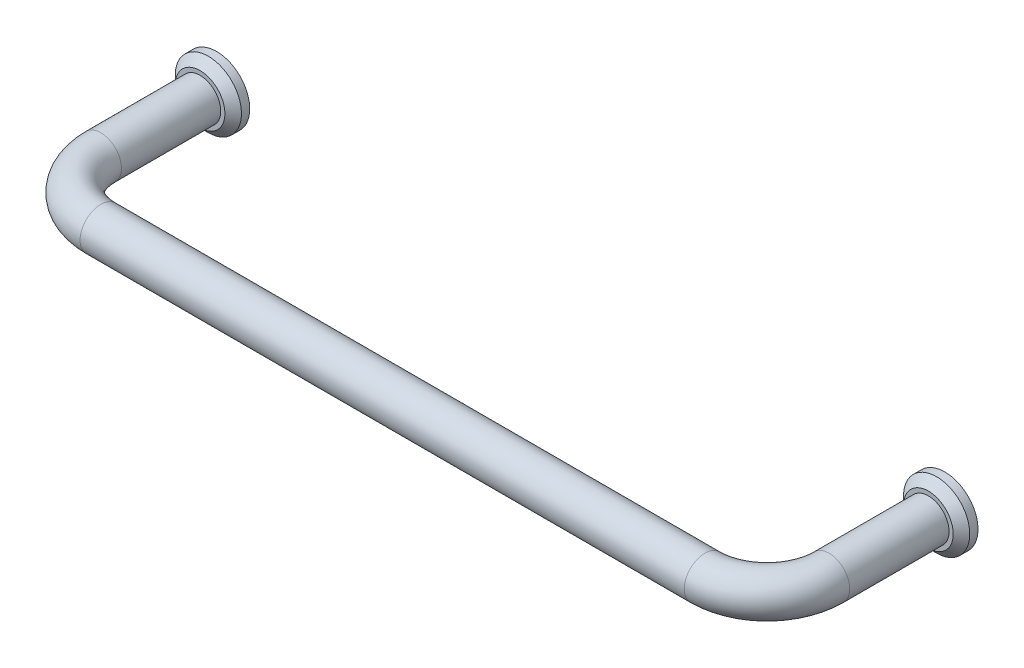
ISO-10303-21;
HEADER;
FILE_DESCRIPTION(('STEP AP214'),'2;1');
FILE_NAME('part.step','',(''),(''),'','','');
FILE_SCHEMA(('AUTOMOTIVE_DESIGN { 1 0 10303 214 1 1 1 1 }'));
ENDSEC;
DATA;
#1=APPLICATION_CONTEXT('core data for automotive mechanical design processes');
#2=APPLICATION_PROTOCOL_DEFINITION('international standard','automotive_design',2000,#1);
#3=PRODUCT_CONTEXT('',#1,'mechanical');
#4=PRODUCT('Part','Part','',(#3));
#5=PRODUCT_RELATED_PRODUCT_CATEGORY('part','',(#4));
#6=PRODUCT_DEFINITION_FORMATION('','',#4);
#7=PRODUCT_DEFINITION_CONTEXT('part definition',#1,'design');
#8=PRODUCT_DEFINITION('design','',#6,#7);
#9=PRODUCT_DEFINITION_SHAPE('','',#8);
#10=(LENGTH_UNIT() NAMED_UNIT(*) SI_UNIT(.MILLI.,.METRE.));
#11=(NAMED_UNIT(*) PLANE_ANGLE_UNIT() SI_UNIT($,.RADIAN.));
#12=(NAMED_UNIT(*) SI_UNIT($,.STERADIAN.) SOLID_ANGLE_UNIT());
#13=UNCERTAINTY_MEASURE_WITH_UNIT(LENGTH_MEASURE(1.E-05),#10,'distance_accuracy_value','');
#14=(GEOMETRIC_REPRESENTATION_CONTEXT(3) GLOBAL_UNCERTAINTY_ASSIGNED_CONTEXT((#13)) GLOBAL_UNIT_ASSIGNED_CONTEXT((#10,
#11,#12)) REPRESENTATION_CONTEXT('',''));
#15=CARTESIAN_POINT('',(0.,0.,0.));
#16=DIRECTION('',(0.,0.,1.));
#17=DIRECTION('',(1.,0.,0.));
#18=AXIS2_PLACEMENT_3D('',#15,#16,#17);
#19=CARTESIAN_POINT('',(0.,0.,0.));
#20=DIRECTION('',(0.,0.,-1.));
#21=DIRECTION('',(0.,1.,0.));
#22=AXIS2_PLACEMENT_3D('',#19,#20,#21);
#23=PLANE('',#22);
#24=CARTESIAN_POINT('',(0.,0.,0.));
#25=DIRECTION('',(0.,0.,1.));
#26=DIRECTION('',(0.,-1.,0.));
#27=AXIS2_PLACEMENT_3D('',#24,#25,#26);
#28=CIRCLE('',#27,4.);
#29=CARTESIAN_POINT('',(0.,-4.,0.));
#30=VERTEX_POINT('',#29);
#31=EDGE_CURVE('E56',#30,#30,#28,.T.);
#32=ORIENTED_EDGE('',*,*,#31,.F.);
#33=EDGE_LOOP('',(#32));
#34=FACE_BOUND('',#33,.T.);
#35=CARTESIAN_POINT('',(0.,0.,0.));
#36=DIRECTION('',(0.,0.,1.));
#37=DIRECTION('',(0.,-1.,0.));
#38=AXIS2_PLACEMENT_3D('',#35,#36,#37);
#39=CIRCLE('',#38,1.5);
#40=CARTESIAN_POINT('',(0.,-1.5,0.));
#41=VERTEX_POINT('',#40);
#42=EDGE_CURVE('E62',#41,#41,#39,.T.);
#43=ORIENTED_EDGE('',*,*,#42,.T.);
#44=EDGE_LOOP('',(#43));
#45=FACE_BOUND('',#44,.T.);
#46=ADVANCED_FACE('F12',(#34,#45),#23,.T.);
#47=CARTESIAN_POINT('',(0.,0.,14.));
#48=DIRECTION('',(0.,0.,-1.));
#49=DIRECTION('',(-1.,0.,0.));
#50=AXIS2_PLACEMENT_3D('',#47,#48,#49);
#51=CYLINDRICAL_SURFACE('',#50,2.5);
#52=CARTESIAN_POINT('',(0.,0.,14.));
#53=DIRECTION('',(0.,0.,-1.));
#54=DIRECTION('',(0.,1.,0.));
#55=AXIS2_PLACEMENT_3D('',#52,#53,#54);
#56=CIRCLE('',#55,2.5);
#57=CARTESIAN_POINT('',(-2.5,0.,14.));
#58=VERTEX_POINT('',#57);
#59=EDGE_CURVE('E20',#58,#58,#56,.T.);
#60=ORIENTED_EDGE('',*,*,#59,.T.);
#61=EDGE_LOOP('',(#60));
#62=FACE_BOUND('',#61,.T.);
#63=CARTESIAN_POINT('',(0.,0.,2.00000000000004));
#64=DIRECTION('',(0.,0.,-1.));
#65=DIRECTION('',(0.,-1.,0.));
#66=AXIS2_PLACEMENT_3D('',#63,#64,#65);
#67=CIRCLE('',#66,2.5);
#68=CARTESIAN_POINT('',(0.,-2.5,2.00000000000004));
#69=VERTEX_POINT('',#68);
#70=EDGE_CURVE('E16',#69,#69,#67,.F.);
#71=ORIENTED_EDGE('',*,*,#70,.T.);
#72=EDGE_LOOP('',(#71));
#73=FACE_BOUND('',#72,.T.);
#74=ADVANCED_FACE('F14',(#62,#73),#51,.T.);
#75=CARTESIAN_POINT('',(88.,0.,14.));
#76=DIRECTION('',(0.,0.,-1.));
#77=DIRECTION('',(0.,-1.,0.));
#78=AXIS2_PLACEMENT_3D('',#75,#76,#77);
#79=CYLINDRICAL_SURFACE('',#78,2.5);
#80=CARTESIAN_POINT('',(88.,0.,14.));
#81=DIRECTION('',(0.,0.,1.));
#82=DIRECTION('',(0.,1.,0.));
#83=AXIS2_PLACEMENT_3D('',#80,#81,#82);
#84=CIRCLE('',#83,2.5);
#85=CARTESIAN_POINT('',(90.5,0.,14.));
#86=VERTEX_POINT('',#85);
#87=EDGE_CURVE('E32',#86,#86,#84,.T.);
#88=ORIENTED_EDGE('',*,*,#87,.F.);
#89=EDGE_LOOP('',(#88));
#90=FACE_BOUND('',#89,.T.);
#91=CARTESIAN_POINT('',(88.,0.,2.));
#92=DIRECTION('',(0.,0.,-1.));
#93=DIRECTION('',(0.,-1.,0.));
#94=AXIS2_PLACEMENT_3D('',#91,#92,#93);
#95=CIRCLE('',#94,2.5);
#96=CARTESIAN_POINT('',(88.,-2.5,2.));
#97=VERTEX_POINT('',#96);
#98=EDGE_CURVE('E8',#97,#97,#95,.T.);
#99=ORIENTED_EDGE('',*,*,#98,.F.);
#100=EDGE_LOOP('',(#99));
#101=FACE_BOUND('',#100,.T.);
#102=ADVANCED_FACE('F91',(#90,#101),#79,.T.);
#103=CARTESIAN_POINT('',(7.5,0.,14.));
#104=DIRECTION('',(0.,-1.,0.));
#105=DIRECTION('',(1.,0.,0.));
#106=AXIS2_PLACEMENT_3D('',#103,#104,#105);
#107=TOROIDAL_SURFACE('',#106,7.5,2.5);
#108=CARTESIAN_POINT('',(7.5,0.,21.5));
#109=DIRECTION('',(-1.,0.,0.));
#110=DIRECTION('',(0.,1.,0.));
#111=AXIS2_PLACEMENT_3D('',#108,#109,#110);
#112=CIRCLE('',#111,2.5);
#113=CARTESIAN_POINT('',(7.5,0.,24.));
#114=VERTEX_POINT('',#113);
#115=EDGE_CURVE('E24',#114,#114,#112,.T.);
#116=CARTESIAN_POINT('',(7.5,0.,14.));
#117=DIRECTION('',(0.,-1.,0.));
#118=DIRECTION('',(1.,0.,0.));
#119=AXIS2_PLACEMENT_3D('',#116,#117,#118);
#120=CIRCLE('',#119,10.);
#121=EDGE_CURVE('',#114,#58,#120,.T.);
#122=ORIENTED_EDGE('',*,*,#115,.T.);
#123=ORIENTED_EDGE('',*,*,#59,.F.);
#124=ORIENTED_EDGE('',*,*,#121,.T.);
#125=ORIENTED_EDGE('',*,*,#121,.F.);
#126=EDGE_LOOP('',(#122,#124,#123,#125));
#127=FACE_BOUND('',#126,.T.);
#128=ADVANCED_FACE('F100',(#127),#107,.T.);
#129=CARTESIAN_POINT('',(80.5,0.,21.5));
#130=DIRECTION('',(-1.,0.,0.));
#131=DIRECTION('',(0.,-1.,0.));
#132=AXIS2_PLACEMENT_3D('',#129,#130,#131);
#133=CYLINDRICAL_SURFACE('',#132,2.5);
#134=CARTESIAN_POINT('',(80.5,0.,21.5));
#135=DIRECTION('',(-1.,0.,0.));
#136=DIRECTION('',(0.,1.,0.));
#137=AXIS2_PLACEMENT_3D('',#134,#135,#136);
#138=CIRCLE('',#137,2.5);
#139=CARTESIAN_POINT('',(80.5,0.,24.));
#140=VERTEX_POINT('',#139);
#141=EDGE_CURVE('E29',#140,#140,#138,.T.);
#142=ORIENTED_EDGE('',*,*,#141,.T.);
#143=EDGE_LOOP('',(#142));
#144=FACE_BOUND('',#143,.T.);
#145=ORIENTED_EDGE('',*,*,#115,.F.);
#146=EDGE_LOOP('',(#145));
#147=FACE_BOUND('',#146,.T.);
#148=ADVANCED_FACE('F106',(#144,#147),#133,.T.);
#149=CARTESIAN_POINT('',(80.5,0.,14.));
#150=DIRECTION('',(0.,-1.,0.));
#151=DIRECTION('',(1.,0.,0.));
#152=AXIS2_PLACEMENT_3D('',#149,#150,#151);
#153=TOROIDAL_SURFACE('',#152,7.5,2.5);
#154=CARTESIAN_POINT('',(80.5,0.,14.));
#155=DIRECTION('',(0.,-1.,0.));
#156=DIRECTION('',(1.,0.,0.));
#157=AXIS2_PLACEMENT_3D('',#154,#155,#156);
#158=CIRCLE('',#157,10.);
#159=EDGE_CURVE('',#86,#140,#158,.T.);
#160=ORIENTED_EDGE('',*,*,#87,.T.);
#161=ORIENTED_EDGE('',*,*,#141,.F.);
#162=ORIENTED_EDGE('',*,*,#159,.T.);
#163=ORIENTED_EDGE('',*,*,#159,.F.);
#164=EDGE_LOOP('',(#160,#162,#161,#163));
#165=FACE_BOUND('',#164,.T.);
#166=ADVANCED_FACE('F102',(#165),#153,.T.);
#167=CARTESIAN_POINT('',(88.,0.,2.));
#168=DIRECTION('',(0.,0.,-1.));
#169=DIRECTION('',(0.,-1.,0.));
#170=AXIS2_PLACEMENT_3D('',#167,#168,#169);
#171=PLANE('',#170);
#172=CARTESIAN_POINT('',(88.,0.,2.));
#173=DIRECTION('',(0.,0.,-1.));
#174=DIRECTION('',(0.,-1.,0.));
#175=AXIS2_PLACEMENT_3D('',#172,#173,#174);
#176=CIRCLE('',#175,3.);
#177=CARTESIAN_POINT('',(88.,-3.,2.));
#178=VERTEX_POINT('',#177);
#179=EDGE_CURVE('E35',#178,#178,#176,.T.);
#180=ORIENTED_EDGE('',*,*,#179,.F.);
#181=EDGE_LOOP('',(#180));
#182=FACE_BOUND('',#181,.T.);
#183=ORIENTED_EDGE('',*,*,#98,.T.);
#184=EDGE_LOOP('',(#183));
#185=FACE_BOUND('',#184,.T.);
#186=ADVANCED_FACE('F105',(#182,#185),#171,.F.);
#187=CARTESIAN_POINT('',(88.,0.,2.));
#188=DIRECTION('',(0.,0.,-1.));
#189=DIRECTION('',(0.,-1.,0.));
#190=AXIS2_PLACEMENT_3D('',#187,#188,#189);
#191=CONICAL_SURFACE('',#190,3.,0.785398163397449);
#192=CARTESIAN_POINT('',(88.,0.,0.999999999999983));
#193=DIRECTION('',(0.,0.,-1.));
#194=DIRECTION('',(0.,-1.,0.));
#195=AXIS2_PLACEMENT_3D('',#192,#193,#194);
#196=CIRCLE('',#195,4.);
#197=CARTESIAN_POINT('',(88.,-4.,0.999999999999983));
#198=VERTEX_POINT('',#197);
#199=EDGE_CURVE('E38',#198,#198,#196,.T.);
#200=ORIENTED_EDGE('',*,*,#199,.F.);
#201=EDGE_LOOP('',(#200));
#202=FACE_BOUND('',#201,.T.);
#203=ORIENTED_EDGE('',*,*,#179,.T.);
#204=EDGE_LOOP('',(#203));
#205=FACE_BOUND('',#204,.T.);
#206=ADVANCED_FACE('F146',(#202,#205),#191,.T.);
#207=CARTESIAN_POINT('',(88.,0.,0.));
#208=DIRECTION('',(0.,0.,-1.));
#209=DIRECTION('',(0.,-1.,0.));
#210=AXIS2_PLACEMENT_3D('',#207,#208,#209);
#211=CYLINDRICAL_SURFACE('',#210,4.);
#212=CARTESIAN_POINT('',(88.,0.,0.));
#213=DIRECTION('',(0.,0.,-1.));
#214=DIRECTION('',(0.,-1.,0.));
#215=AXIS2_PLACEMENT_3D('',#212,#213,#214);
#216=CIRCLE('',#215,4.);
#217=CARTESIAN_POINT('',(88.,-4.,0.));
#218=VERTEX_POINT('',#217);
#219=EDGE_CURVE('E41',#218,#218,#216,.T.);
#220=ORIENTED_EDGE('',*,*,#219,.F.);
#221=EDGE_LOOP('',(#220));
#222=FACE_BOUND('',#221,.T.);
#223=ORIENTED_EDGE('',*,*,#199,.T.);
#224=EDGE_LOOP('',(#223));
#225=FACE_BOUND('',#224,.T.);
#226=ADVANCED_FACE('F143',(#222,#225),#211,.T.);
#227=CARTESIAN_POINT('',(88.,0.,0.));
#228=DIRECTION('',(0.,0.,1.));
#229=DIRECTION('',(0.,1.,0.));
#230=AXIS2_PLACEMENT_3D('',#227,#228,#229);
#231=PLANE('',#230);
#232=CARTESIAN_POINT('',(88.,0.,0.));
#233=DIRECTION('',(0.,0.,-1.));
#234=DIRECTION('',(0.,-1.,0.));
#235=AXIS2_PLACEMENT_3D('',#232,#233,#234);
#236=CIRCLE('',#235,1.5);
#237=CARTESIAN_POINT('',(88.,-1.5,0.));
#238=VERTEX_POINT('',#237);
#239=EDGE_CURVE('E47',#238,#238,#236,.T.);
#240=ORIENTED_EDGE('',*,*,#239,.F.);
#241=EDGE_LOOP('',(#240));
#242=FACE_BOUND('',#241,.T.);
#243=ORIENTED_EDGE('',*,*,#219,.T.);
#244=EDGE_LOOP('',(#243));
#245=FACE_BOUND('',#244,.T.);
#246=ADVANCED_FACE('F96',(#242,#245),#231,.F.);
#247=CARTESIAN_POINT('',(88.,0.,7.));
#248=DIRECTION('',(0.,0.,-1.));
#249=DIRECTION('',(0.,-1.,0.));
#250=AXIS2_PLACEMENT_3D('',#247,#248,#249);
#251=CYLINDRICAL_SURFACE('',#250,1.5);
#252=CARTESIAN_POINT('',(88.,0.,7.));
#253=DIRECTION('',(0.,0.,-1.));
#254=DIRECTION('',(0.,-1.,0.));
#255=AXIS2_PLACEMENT_3D('',#252,#253,#254);
#256=CIRCLE('',#255,1.5);
#257=CARTESIAN_POINT('',(88.,-1.5,7.));
#258=VERTEX_POINT('',#257);
#259=EDGE_CURVE('E44',#258,#258,#256,.T.);
#260=ORIENTED_EDGE('',*,*,#259,.F.);
#261=EDGE_LOOP('',(#260));
#262=FACE_BOUND('',#261,.T.);
#263=ORIENTED_EDGE('',*,*,#239,.T.);
#264=EDGE_LOOP('',(#263));
#265=FACE_BOUND('',#264,.T.);
#266=ADVANCED_FACE('F127',(#262,#265),#251,.F.);
#267=CARTESIAN_POINT('',(88.,0.,7.));
#268=DIRECTION('',(0.,0.,-1.));
#269=DIRECTION('',(0.,-1.,0.));
#270=AXIS2_PLACEMENT_3D('',#267,#268,#269);
#271=PLANE('',#270);
#272=ORIENTED_EDGE('',*,*,#259,.T.);
#273=EDGE_LOOP('',(#272));
#274=FACE_BOUND('',#273,.T.);
#275=ADVANCED_FACE('F125',(#274),#271,.T.);
#276=CARTESIAN_POINT('',(0.,0.,2.00000000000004));
#277=DIRECTION('',(0.,0.,-1.));
#278=DIRECTION('',(0.,-1.,0.));
#279=AXIS2_PLACEMENT_3D('',#276,#277,#278);
#280=PLANE('',#279);
#281=ORIENTED_EDGE('',*,*,#70,.F.);
#282=EDGE_LOOP('',(#281));
#283=FACE_BOUND('',#282,.T.);
#284=CARTESIAN_POINT('',(0.,0.,2.00000000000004));
#285=DIRECTION('',(0.,0.,1.));
#286=DIRECTION('',(0.,-1.,0.));
#287=AXIS2_PLACEMENT_3D('',#284,#285,#286);
#288=CIRCLE('',#287,3.);
#289=CARTESIAN_POINT('',(0.,-3.,2.00000000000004));
#290=VERTEX_POINT('',#289);
#291=EDGE_CURVE('E50',#290,#290,#288,.T.);
#292=ORIENTED_EDGE('',*,*,#291,.T.);
#293=EDGE_LOOP('',(#292));
#294=FACE_BOUND('',#293,.T.);
#295=ADVANCED_FACE('F122',(#283,#294),#280,.F.);
#296=CARTESIAN_POINT('',(0.,0.,2.00000000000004));
#297=DIRECTION('',(0.,0.,-1.));
#298=DIRECTION('',(0.,-1.,0.));
#299=AXIS2_PLACEMENT_3D('',#296,#297,#298);
#300=CONICAL_SURFACE('',#299,3.,0.785398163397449);
#301=CARTESIAN_POINT('',(0.,0.,1.00000000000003));
#302=DIRECTION('',(0.,0.,1.));
#303=DIRECTION('',(0.,-1.,0.));
#304=AXIS2_PLACEMENT_3D('',#301,#302,#303);
#305=CIRCLE('',#304,4.);
#306=CARTESIAN_POINT('',(0.,-4.,1.00000000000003));
#307=VERTEX_POINT('',#306);
#308=EDGE_CURVE('E53',#307,#307,#305,.T.);
#309=ORIENTED_EDGE('',*,*,#308,.T.);
#310=EDGE_LOOP('',(#309));
#311=FACE_BOUND('',#310,.T.);
#312=ORIENTED_EDGE('',*,*,#291,.F.);
#313=EDGE_LOOP('',(#312));
#314=FACE_BOUND('',#313,.T.);
#315=ADVANCED_FACE('F81',(#311,#314),#300,.T.);
#316=CARTESIAN_POINT('',(0.,0.,0.));
#317=DIRECTION('',(0.,0.,-1.));
#318=DIRECTION('',(0.,-1.,0.));
#319=AXIS2_PLACEMENT_3D('',#316,#317,#318);
#320=CYLINDRICAL_SURFACE('',#319,4.);
#321=ORIENTED_EDGE('',*,*,#31,.T.);
#322=EDGE_LOOP('',(#321));
#323=FACE_BOUND('',#322,.T.);
#324=ORIENTED_EDGE('',*,*,#308,.F.);
#325=EDGE_LOOP('',(#324));
#326=FACE_BOUND('',#325,.T.);
#327=ADVANCED_FACE('F70',(#323,#326),#320,.T.);
#328=CARTESIAN_POINT('',(0.,0.,7.));
#329=DIRECTION('',(0.,0.,-1.));
#330=DIRECTION('',(0.,-1.,0.));
#331=AXIS2_PLACEMENT_3D('',#328,#329,#330);
#332=CYLINDRICAL_SURFACE('',#331,1.5);
#333=CARTESIAN_POINT('',(0.,0.,7.));
#334=DIRECTION('',(0.,0.,1.));
#335=DIRECTION('',(0.,-1.,0.));
#336=AXIS2_PLACEMENT_3D('',#333,#334,#335);
#337=CIRCLE('',#336,1.5);
#338=CARTESIAN_POINT('',(0.,-1.5,7.));
#339=VERTEX_POINT('',#338);
#340=EDGE_CURVE('E59',#339,#339,#337,.T.);
#341=ORIENTED_EDGE('',*,*,#340,.T.);
#342=EDGE_LOOP('',(#341));
#343=FACE_BOUND('',#342,.T.);
#344=ORIENTED_EDGE('',*,*,#42,.F.);
#345=EDGE_LOOP('',(#344));
#346=FACE_BOUND('',#345,.T.);
#347=ADVANCED_FACE('F67',(#343,#346),#332,.F.);
#348=CARTESIAN_POINT('',(0.,0.,7.));
#349=DIRECTION('',(0.,0.,-1.));
#350=DIRECTION('',(0.,-1.,0.));
#351=AXIS2_PLACEMENT_3D('',#348,#349,#350);
#352=PLANE('',#351);
#353=ORIENTED_EDGE('',*,*,#340,.F.);
#354=EDGE_LOOP('',(#353));
#355=FACE_BOUND('',#354,.T.);
#356=ADVANCED_FACE('F69',(#355),#352,.T.);
#357=CLOSED_SHELL('',(#46,#74,#102,#128,#148,#166,#186,#206,#226,#246,#266,#275,#295,#315,#327,
#347,#356));
#358=MANIFOLD_SOLID_BREP('B1',#357);
#359=ADVANCED_BREP_SHAPE_REPRESENTATION('',(#18,#358),#14);
#360=SHAPE_DEFINITION_REPRESENTATION(#9,#359);
ENDSEC;
END-ISO-10303-21;
